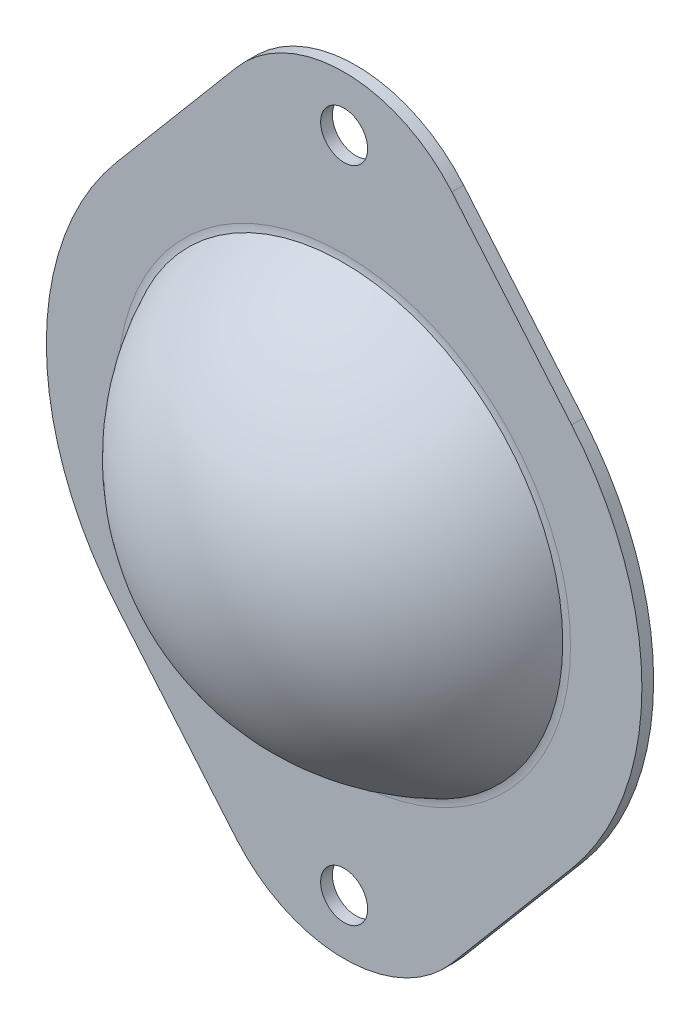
ISO-10303-21;
HEADER;
FILE_DESCRIPTION(('STEP AP214'),'2;1');
FILE_NAME('part.step','',(''),(''),'','','');
FILE_SCHEMA(('AUTOMOTIVE_DESIGN { 1 0 10303 214 1 1 1 1 }'));
ENDSEC;
DATA;
#1=APPLICATION_CONTEXT('core data for automotive mechanical design processes');
#2=APPLICATION_PROTOCOL_DEFINITION('international standard','automotive_design',2000,#1);
#3=PRODUCT_CONTEXT('',#1,'mechanical');
#4=PRODUCT('Part','Part','',(#3));
#5=PRODUCT_RELATED_PRODUCT_CATEGORY('part','',(#4));
#6=PRODUCT_DEFINITION_FORMATION('','',#4);
#7=PRODUCT_DEFINITION_CONTEXT('part definition',#1,'design');
#8=PRODUCT_DEFINITION('design','',#6,#7);
#9=PRODUCT_DEFINITION_SHAPE('','',#8);
#10=(LENGTH_UNIT() NAMED_UNIT(*) SI_UNIT(.MILLI.,.METRE.));
#11=(NAMED_UNIT(*) PLANE_ANGLE_UNIT() SI_UNIT($,.RADIAN.));
#12=(NAMED_UNIT(*) SI_UNIT($,.STERADIAN.) SOLID_ANGLE_UNIT());
#13=UNCERTAINTY_MEASURE_WITH_UNIT(LENGTH_MEASURE(1.E-05),#10,'distance_accuracy_value','');
#14=(GEOMETRIC_REPRESENTATION_CONTEXT(3) GLOBAL_UNCERTAINTY_ASSIGNED_CONTEXT((#13)) GLOBAL_UNIT_ASSIGNED_CONTEXT((#10,
#11,#12)) REPRESENTATION_CONTEXT('',''));
#15=CARTESIAN_POINT('',(0.,0.,0.));
#16=DIRECTION('',(0.,0.,1.));
#17=DIRECTION('',(1.,0.,0.));
#18=AXIS2_PLACEMENT_3D('',#15,#16,#17);
#19=CARTESIAN_POINT('',(0.,0.,1.5));
#20=DIRECTION('',(0.,0.,1.));
#21=DIRECTION('',(1.,0.,0.));
#22=AXIS2_PLACEMENT_3D('',#19,#20,#21);
#23=PLANE('',#22);
#24=CARTESIAN_POINT('',(0.,0.,1.5));
#25=DIRECTION('',(0.,0.,1.));
#26=DIRECTION('',(1.,0.,0.));
#27=AXIS2_PLACEMENT_3D('',#24,#25,#26);
#28=CIRCLE('',#27,28.8888194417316);
#29=CARTESIAN_POINT('',(28.8888194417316,0.,1.5));
#30=VERTEX_POINT('',#29);
#31=EDGE_CURVE('E40',#30,#30,#28,.F.);
#32=ORIENTED_EDGE('',*,*,#31,.T.);
#33=EDGE_LOOP('',(#32));
#34=FACE_BOUND('',#33,.T.);
#35=CARTESIAN_POINT('',(0.,-42.,1.5));
#36=DIRECTION('',(0.,0.,1.));
#37=DIRECTION('',(1.,0.,0.));
#38=AXIS2_PLACEMENT_3D('',#35,#36,#37);
#39=CIRCLE('',#38,3.);
#40=CARTESIAN_POINT('',(3.,-42.,1.5));
#41=VERTEX_POINT('',#40);
#42=EDGE_CURVE('E187',#41,#41,#39,.T.);
#43=ORIENTED_EDGE('',*,*,#42,.F.);
#44=EDGE_LOOP('',(#43));
#45=FACE_BOUND('',#44,.T.);
#46=CARTESIAN_POINT('',(0.,0.,1.5));
#47=DIRECTION('',(0.,0.,1.));
#48=DIRECTION('',(1.,0.,0.));
#49=AXIS2_PLACEMENT_3D('',#46,#47,#48);
#50=CIRCLE('',#49,38.);
#51=CARTESIAN_POINT('',(-29.033763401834,24.516129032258,1.5));
#52=VERTEX_POINT('',#51);
#53=CARTESIAN_POINT('',(-29.033763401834,-24.5161290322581,1.5));
#54=VERTEX_POINT('',#53);
#55=EDGE_CURVE('E139',#52,#54,#50,.T.);
#56=ORIENTED_EDGE('',*,*,#55,.T.);
#57=DIRECTION('',(0.645161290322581,-0.76404640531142,0.));
#58=VECTOR('',#57,1.);
#59=CARTESIAN_POINT('',(-29.033763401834,-24.5161290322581,1.5));
#60=LINE('',#59,#58);
#61=CARTESIAN_POINT('',(-13.7528352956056,-42.6129032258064,1.5));
#62=VERTEX_POINT('',#61);
#63=EDGE_CURVE('E113',#54,#62,#60,.T.);
#64=ORIENTED_EDGE('',*,*,#63,.T.);
#65=CARTESIAN_POINT('',(0.,-31.,1.5));
#66=DIRECTION('',(0.,0.,1.));
#67=DIRECTION('',(1.,0.,0.));
#68=AXIS2_PLACEMENT_3D('',#65,#66,#67);
#69=CIRCLE('',#68,18.);
#70=CARTESIAN_POINT('',(13.7528352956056,-42.6129032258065,1.5));
#71=VERTEX_POINT('',#70);
#72=EDGE_CURVE('E142',#62,#71,#69,.T.);
#73=ORIENTED_EDGE('',*,*,#72,.T.);
#74=DIRECTION('',(0.64516129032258,0.76404640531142,0.));
#75=VECTOR('',#74,1.);
#76=CARTESIAN_POINT('',(29.033763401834,-24.5161290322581,1.5));
#77=LINE('',#76,#75);
#78=CARTESIAN_POINT('',(29.033763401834,-24.5161290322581,1.5));
#79=VERTEX_POINT('',#78);
#80=EDGE_CURVE('E144',#71,#79,#77,.T.);
#81=ORIENTED_EDGE('',*,*,#80,.T.);
#82=CARTESIAN_POINT('',(0.,0.,1.5));
#83=DIRECTION('',(0.,0.,1.));
#84=DIRECTION('',(1.,0.,0.));
#85=AXIS2_PLACEMENT_3D('',#82,#83,#84);
#86=CIRCLE('',#85,38.);
#87=CARTESIAN_POINT('',(29.0337634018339,24.5161290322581,1.5));
#88=VERTEX_POINT('',#87);
#89=EDGE_CURVE('E146',#79,#88,#86,.T.);
#90=ORIENTED_EDGE('',*,*,#89,.T.);
#91=DIRECTION('',(-0.64516129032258,0.76404640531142,0.));
#92=VECTOR('',#91,1.);
#93=CARTESIAN_POINT('',(13.7528352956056,42.6129032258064,1.5));
#94=LINE('',#93,#92);
#95=CARTESIAN_POINT('',(13.7528352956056,42.6129032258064,1.5));
#96=VERTEX_POINT('',#95);
#97=EDGE_CURVE('E148',#88,#96,#94,.T.);
#98=ORIENTED_EDGE('',*,*,#97,.T.);
#99=CARTESIAN_POINT('',(0.,31.,1.5));
#100=DIRECTION('',(0.,0.,1.));
#101=DIRECTION('',(1.,0.,0.));
#102=AXIS2_PLACEMENT_3D('',#99,#100,#101);
#103=CIRCLE('',#102,18.);
#104=CARTESIAN_POINT('',(-13.7528352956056,42.6129032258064,1.5));
#105=VERTEX_POINT('',#104);
#106=EDGE_CURVE('E52',#96,#105,#103,.T.);
#107=ORIENTED_EDGE('',*,*,#106,.T.);
#108=DIRECTION('',(-0.64516129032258,-0.76404640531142,0.));
#109=VECTOR('',#108,1.);
#110=CARTESIAN_POINT('',(-13.7528352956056,42.6129032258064,1.5));
#111=LINE('',#110,#109);
#112=EDGE_CURVE('E47',#105,#52,#111,.T.);
#113=ORIENTED_EDGE('',*,*,#112,.T.);
#114=EDGE_LOOP('',(#56,#64,#73,#81,#90,#98,#107,#113));
#115=FACE_BOUND('',#114,.T.);
#116=CARTESIAN_POINT('',(0.,42.,1.5));
#117=DIRECTION('',(0.,0.,1.));
#118=DIRECTION('',(1.,0.,0.));
#119=AXIS2_PLACEMENT_3D('',#116,#117,#118);
#120=CIRCLE('',#119,3.);
#121=CARTESIAN_POINT('',(3.,42.,1.5));
#122=VERTEX_POINT('',#121);
#123=EDGE_CURVE('E121',#122,#122,#120,.T.);
#124=ORIENTED_EDGE('',*,*,#123,.F.);
#125=EDGE_LOOP('',(#124));
#126=FACE_BOUND('',#125,.T.);
#127=ADVANCED_FACE('F32',(#34,#45,#115,#126),#23,.T.);
#128=CARTESIAN_POINT('',(0.,0.,0.));
#129=DIRECTION('',(0.,0.,1.));
#130=DIRECTION('',(1.,0.,0.));
#131=AXIS2_PLACEMENT_3D('',#128,#129,#130);
#132=PLANE('',#131);
#133=CARTESIAN_POINT('',(0.,0.,0.));
#134=DIRECTION('',(0.,0.,1.));
#135=DIRECTION('',(1.,0.,0.));
#136=AXIS2_PLACEMENT_3D('',#133,#134,#135);
#137=CIRCLE('',#136,29.4232084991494);
#138=CARTESIAN_POINT('',(29.4232084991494,0.,0.));
#139=VERTEX_POINT('',#138);
#140=EDGE_CURVE('E11',#139,#139,#137,.T.);
#141=ORIENTED_EDGE('',*,*,#140,.T.);
#142=EDGE_LOOP('',(#141));
#143=FACE_BOUND('',#142,.T.);
#144=CARTESIAN_POINT('',(0.,42.,0.));
#145=DIRECTION('',(0.,0.,1.));
#146=DIRECTION('',(1.,0.,0.));
#147=AXIS2_PLACEMENT_3D('',#144,#145,#146);
#148=CIRCLE('',#147,3.);
#149=CARTESIAN_POINT('',(3.,42.,0.));
#150=VERTEX_POINT('',#149);
#151=EDGE_CURVE('E124',#150,#150,#148,.T.);
#152=ORIENTED_EDGE('',*,*,#151,.T.);
#153=EDGE_LOOP('',(#152));
#154=FACE_BOUND('',#153,.T.);
#155=CARTESIAN_POINT('',(0.,0.,0.));
#156=DIRECTION('',(0.,0.,1.));
#157=DIRECTION('',(1.,0.,0.));
#158=AXIS2_PLACEMENT_3D('',#155,#156,#157);
#159=CIRCLE('',#158,38.);
#160=CARTESIAN_POINT('',(-29.033763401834,24.516129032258,0.));
#161=VERTEX_POINT('',#160);
#162=CARTESIAN_POINT('',(-29.033763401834,-24.5161290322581,0.));
#163=VERTEX_POINT('',#162);
#164=EDGE_CURVE('E103',#161,#163,#159,.T.);
#165=ORIENTED_EDGE('',*,*,#164,.F.);
#166=DIRECTION('',(-0.64516129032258,-0.76404640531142,0.));
#167=VECTOR('',#166,1.);
#168=CARTESIAN_POINT('',(-13.7528352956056,42.6129032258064,0.));
#169=LINE('',#168,#167);
#170=CARTESIAN_POINT('',(-13.7528352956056,42.6129032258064,0.));
#171=VERTEX_POINT('',#170);
#172=EDGE_CURVE('E137',#171,#161,#169,.T.);
#173=ORIENTED_EDGE('',*,*,#172,.F.);
#174=CARTESIAN_POINT('',(0.,31.,0.));
#175=DIRECTION('',(0.,0.,1.));
#176=DIRECTION('',(1.,0.,0.));
#177=AXIS2_PLACEMENT_3D('',#174,#175,#176);
#178=CIRCLE('',#177,18.);
#179=CARTESIAN_POINT('',(13.7528352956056,42.6129032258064,0.));
#180=VERTEX_POINT('',#179);
#181=EDGE_CURVE('E135',#180,#171,#178,.T.);
#182=ORIENTED_EDGE('',*,*,#181,.F.);
#183=DIRECTION('',(-0.64516129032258,0.76404640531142,0.));
#184=VECTOR('',#183,1.);
#185=CARTESIAN_POINT('',(13.7528352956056,42.6129032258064,0.));
#186=LINE('',#185,#184);
#187=CARTESIAN_POINT('',(29.0337634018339,24.5161290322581,0.));
#188=VERTEX_POINT('',#187);
#189=EDGE_CURVE('E133',#188,#180,#186,.T.);
#190=ORIENTED_EDGE('',*,*,#189,.F.);
#191=CARTESIAN_POINT('',(0.,0.,0.));
#192=DIRECTION('',(0.,0.,1.));
#193=DIRECTION('',(1.,0.,0.));
#194=AXIS2_PLACEMENT_3D('',#191,#192,#193);
#195=CIRCLE('',#194,38.);
#196=CARTESIAN_POINT('',(29.033763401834,-24.5161290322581,0.));
#197=VERTEX_POINT('',#196);
#198=EDGE_CURVE('E131',#197,#188,#195,.T.);
#199=ORIENTED_EDGE('',*,*,#198,.F.);
#200=DIRECTION('',(0.64516129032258,0.76404640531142,0.));
#201=VECTOR('',#200,1.);
#202=CARTESIAN_POINT('',(29.033763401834,-24.5161290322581,0.));
#203=LINE('',#202,#201);
#204=CARTESIAN_POINT('',(13.7528352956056,-42.6129032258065,0.));
#205=VERTEX_POINT('',#204);
#206=EDGE_CURVE('E129',#205,#197,#203,.T.);
#207=ORIENTED_EDGE('',*,*,#206,.F.);
#208=CARTESIAN_POINT('',(0.,-31.,0.));
#209=DIRECTION('',(0.,0.,1.));
#210=DIRECTION('',(1.,0.,0.));
#211=AXIS2_PLACEMENT_3D('',#208,#209,#210);
#212=CIRCLE('',#211,18.);
#213=CARTESIAN_POINT('',(-13.7528352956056,-42.6129032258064,0.));
#214=VERTEX_POINT('',#213);
#215=EDGE_CURVE('E105',#214,#205,#212,.T.);
#216=ORIENTED_EDGE('',*,*,#215,.F.);
#217=DIRECTION('',(0.645161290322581,-0.76404640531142,0.));
#218=VECTOR('',#217,1.);
#219=CARTESIAN_POINT('',(-29.033763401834,-24.5161290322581,0.));
#220=LINE('',#219,#218);
#221=EDGE_CURVE('E97',#163,#214,#220,.T.);
#222=ORIENTED_EDGE('',*,*,#221,.F.);
#223=EDGE_LOOP('',(#165,#173,#182,#190,#199,#207,#216,#222));
#224=FACE_BOUND('',#223,.T.);
#225=CARTESIAN_POINT('',(0.,-42.,0.));
#226=DIRECTION('',(0.,0.,1.));
#227=DIRECTION('',(1.,0.,0.));
#228=AXIS2_PLACEMENT_3D('',#225,#226,#227);
#229=CIRCLE('',#228,3.);
#230=CARTESIAN_POINT('',(3.,-42.,0.));
#231=VERTEX_POINT('',#230);
#232=EDGE_CURVE('E183',#231,#231,#229,.T.);
#233=ORIENTED_EDGE('',*,*,#232,.T.);
#234=EDGE_LOOP('',(#233));
#235=FACE_BOUND('',#234,.T.);
#236=ADVANCED_FACE('F99',(#143,#154,#224,#235),#132,.F.);
#237=CARTESIAN_POINT('',(0.,0.,1.5));
#238=DIRECTION('',(0.,0.,-1.));
#239=DIRECTION('',(-1.,0.,0.));
#240=AXIS2_PLACEMENT_3D('',#237,#238,#239);
#241=CYLINDRICAL_SURFACE('',#240,38.);
#242=ORIENTED_EDGE('',*,*,#164,.T.);
#243=DIRECTION('',(0.,0.,-1.));
#244=VECTOR('',#243,1.);
#245=CARTESIAN_POINT('',(-29.033763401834,-24.5161290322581,1.5));
#246=LINE('',#245,#244);
#247=EDGE_CURVE('E111',#54,#163,#246,.T.);
#248=ORIENTED_EDGE('',*,*,#247,.F.);
#249=ORIENTED_EDGE('',*,*,#55,.F.);
#250=DIRECTION('',(0.,0.,-1.));
#251=VECTOR('',#250,1.);
#252=CARTESIAN_POINT('',(-29.033763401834,24.516129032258,1.5));
#253=LINE('',#252,#251);
#254=EDGE_CURVE('E120',#52,#161,#253,.T.);
#255=ORIENTED_EDGE('',*,*,#254,.T.);
#256=EDGE_LOOP('',(#242,#248,#249,#255));
#257=FACE_BOUND('',#256,.T.);
#258=ADVANCED_FACE('F119',(#257),#241,.T.);
#259=CARTESIAN_POINT('',(-29.033763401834,-24.5161290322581,1.5));
#260=DIRECTION('',(0.76404640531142,0.64516129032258,0.));
#261=DIRECTION('',(-0.645161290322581,0.76404640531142,0.));
#262=AXIS2_PLACEMENT_3D('',#259,#260,#261);
#263=PLANE('',#262);
#264=ORIENTED_EDGE('',*,*,#221,.T.);
#265=DIRECTION('',(0.,0.,-1.));
#266=VECTOR('',#265,1.);
#267=CARTESIAN_POINT('',(-13.7528352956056,-42.6129032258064,1.5));
#268=LINE('',#267,#266);
#269=EDGE_CURVE('E116',#62,#214,#268,.T.);
#270=ORIENTED_EDGE('',*,*,#269,.F.);
#271=ORIENTED_EDGE('',*,*,#63,.F.);
#272=ORIENTED_EDGE('',*,*,#247,.T.);
#273=EDGE_LOOP('',(#264,#270,#271,#272));
#274=FACE_BOUND('',#273,.T.);
#275=ADVANCED_FACE('F112',(#274),#263,.F.);
#276=CARTESIAN_POINT('',(0.,-31.,1.5));
#277=DIRECTION('',(0.,0.,-1.));
#278=DIRECTION('',(-1.,0.,0.));
#279=AXIS2_PLACEMENT_3D('',#276,#277,#278);
#280=CYLINDRICAL_SURFACE('',#279,18.);
#281=ORIENTED_EDGE('',*,*,#215,.T.);
#282=DIRECTION('',(0.,0.,-1.));
#283=VECTOR('',#282,1.);
#284=CARTESIAN_POINT('',(13.7528352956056,-42.6129032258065,1.5));
#285=LINE('',#284,#283);
#286=EDGE_CURVE('E165',#71,#205,#285,.T.);
#287=ORIENTED_EDGE('',*,*,#286,.F.);
#288=ORIENTED_EDGE('',*,*,#72,.F.);
#289=ORIENTED_EDGE('',*,*,#269,.T.);
#290=EDGE_LOOP('',(#281,#287,#288,#289));
#291=FACE_BOUND('',#290,.T.);
#292=ADVANCED_FACE('F234',(#291),#280,.T.);
#293=CARTESIAN_POINT('',(29.033763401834,-24.5161290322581,1.5));
#294=DIRECTION('',(-0.76404640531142,0.64516129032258,0.));
#295=DIRECTION('',(-0.645161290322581,-0.76404640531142,0.));
#296=AXIS2_PLACEMENT_3D('',#293,#294,#295);
#297=PLANE('',#296);
#298=ORIENTED_EDGE('',*,*,#206,.T.);
#299=DIRECTION('',(0.,0.,-1.));
#300=VECTOR('',#299,1.);
#301=CARTESIAN_POINT('',(29.033763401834,-24.5161290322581,1.5));
#302=LINE('',#301,#300);
#303=EDGE_CURVE('E162',#79,#197,#302,.T.);
#304=ORIENTED_EDGE('',*,*,#303,.F.);
#305=ORIENTED_EDGE('',*,*,#80,.F.);
#306=ORIENTED_EDGE('',*,*,#286,.T.);
#307=EDGE_LOOP('',(#298,#304,#305,#306));
#308=FACE_BOUND('',#307,.T.);
#309=ADVANCED_FACE('F230',(#308),#297,.F.);
#310=CARTESIAN_POINT('',(0.,0.,1.5));
#311=DIRECTION('',(0.,0.,-1.));
#312=DIRECTION('',(-1.,0.,0.));
#313=AXIS2_PLACEMENT_3D('',#310,#311,#312);
#314=CYLINDRICAL_SURFACE('',#313,38.);
#315=ORIENTED_EDGE('',*,*,#198,.T.);
#316=DIRECTION('',(0.,0.,-1.));
#317=VECTOR('',#316,1.);
#318=CARTESIAN_POINT('',(29.0337634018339,24.5161290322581,1.5));
#319=LINE('',#318,#317);
#320=EDGE_CURVE('E159',#88,#188,#319,.T.);
#321=ORIENTED_EDGE('',*,*,#320,.F.);
#322=ORIENTED_EDGE('',*,*,#89,.F.);
#323=ORIENTED_EDGE('',*,*,#303,.T.);
#324=EDGE_LOOP('',(#315,#321,#322,#323));
#325=FACE_BOUND('',#324,.T.);
#326=ADVANCED_FACE('F226',(#325),#314,.T.);
#327=CARTESIAN_POINT('',(13.7528352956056,42.6129032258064,1.5));
#328=DIRECTION('',(-0.76404640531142,-0.64516129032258,0.));
#329=DIRECTION('',(0.64516129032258,-0.76404640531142,0.));
#330=AXIS2_PLACEMENT_3D('',#327,#328,#329);
#331=PLANE('',#330);
#332=ORIENTED_EDGE('',*,*,#189,.T.);
#333=DIRECTION('',(0.,0.,-1.));
#334=VECTOR('',#333,1.);
#335=CARTESIAN_POINT('',(13.7528352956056,42.6129032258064,1.5));
#336=LINE('',#335,#334);
#337=EDGE_CURVE('E156',#96,#180,#336,.T.);
#338=ORIENTED_EDGE('',*,*,#337,.F.);
#339=ORIENTED_EDGE('',*,*,#97,.F.);
#340=ORIENTED_EDGE('',*,*,#320,.T.);
#341=EDGE_LOOP('',(#332,#338,#339,#340));
#342=FACE_BOUND('',#341,.T.);
#343=ADVANCED_FACE('F222',(#342),#331,.F.);
#344=CARTESIAN_POINT('',(0.,31.,1.5));
#345=DIRECTION('',(0.,0.,-1.));
#346=DIRECTION('',(-1.,0.,0.));
#347=AXIS2_PLACEMENT_3D('',#344,#345,#346);
#348=CYLINDRICAL_SURFACE('',#347,18.);
#349=ORIENTED_EDGE('',*,*,#181,.T.);
#350=DIRECTION('',(0.,0.,-1.));
#351=VECTOR('',#350,1.);
#352=CARTESIAN_POINT('',(-13.7528352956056,42.6129032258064,1.5));
#353=LINE('',#352,#351);
#354=EDGE_CURVE('E153',#105,#171,#353,.T.);
#355=ORIENTED_EDGE('',*,*,#354,.F.);
#356=ORIENTED_EDGE('',*,*,#106,.F.);
#357=ORIENTED_EDGE('',*,*,#337,.T.);
#358=EDGE_LOOP('',(#349,#355,#356,#357));
#359=FACE_BOUND('',#358,.T.);
#360=ADVANCED_FACE('F209',(#359),#348,.T.);
#361=CARTESIAN_POINT('',(-13.7528352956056,42.6129032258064,1.5));
#362=DIRECTION('',(0.76404640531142,-0.64516129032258,0.));
#363=DIRECTION('',(0.645161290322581,0.76404640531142,0.));
#364=AXIS2_PLACEMENT_3D('',#361,#362,#363);
#365=PLANE('',#364);
#366=ORIENTED_EDGE('',*,*,#172,.T.);
#367=ORIENTED_EDGE('',*,*,#254,.F.);
#368=ORIENTED_EDGE('',*,*,#112,.F.);
#369=ORIENTED_EDGE('',*,*,#354,.T.);
#370=EDGE_LOOP('',(#366,#367,#368,#369));
#371=FACE_BOUND('',#370,.T.);
#372=ADVANCED_FACE('F200',(#371),#365,.F.);
#373=CARTESIAN_POINT('',(0.,42.,1.5));
#374=DIRECTION('',(0.,0.,-1.));
#375=DIRECTION('',(-1.,0.,0.));
#376=AXIS2_PLACEMENT_3D('',#373,#374,#375);
#377=CYLINDRICAL_SURFACE('',#376,3.);
#378=ORIENTED_EDGE('',*,*,#123,.T.);
#379=EDGE_LOOP('',(#378));
#380=FACE_BOUND('',#379,.T.);
#381=ORIENTED_EDGE('',*,*,#151,.F.);
#382=EDGE_LOOP('',(#381));
#383=FACE_BOUND('',#382,.T.);
#384=ADVANCED_FACE('F197',(#380,#383),#377,.F.);
#385=CARTESIAN_POINT('',(0.,-42.,1.5));
#386=DIRECTION('',(0.,0.,-1.));
#387=DIRECTION('',(-1.,0.,0.));
#388=AXIS2_PLACEMENT_3D('',#385,#386,#387);
#389=CYLINDRICAL_SURFACE('',#388,3.);
#390=ORIENTED_EDGE('',*,*,#42,.T.);
#391=EDGE_LOOP('',(#390));
#392=FACE_BOUND('',#391,.T.);
#393=ORIENTED_EDGE('',*,*,#232,.F.);
#394=EDGE_LOOP('',(#393));
#395=FACE_BOUND('',#394,.T.);
#396=ADVANCED_FACE('F199',(#392,#395),#389,.F.);
#397=CARTESIAN_POINT('',(0.,0.,-11.1777777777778));
#398=DIRECTION('',(0.,0.,1.));
#399=DIRECTION('',(1.,0.,0.));
#400=AXIS2_PLACEMENT_3D('',#397,#398,#399);
#401=SPHERICAL_SURFACE('',#400,30.7777777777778);
#402=CARTESIAN_POINT('',(0.,0.,1.6));
#403=DIRECTION('',(0.,0.,1.));
#404=DIRECTION('',(1.,0.,0.));
#405=AXIS2_PLACEMENT_3D('',#402,#403,#404);
#406=CIRCLE('',#405,28.);
#407=CARTESIAN_POINT('',(28.,0.,1.6));
#408=VERTEX_POINT('',#407);
#409=EDGE_CURVE('E181',#408,#408,#406,.T.);
#410=ORIENTED_EDGE('',*,*,#409,.T.);
#411=EDGE_LOOP('',(#410));
#412=FACE_BOUND('',#411,.T.);
#413=ADVANCED_FACE('F34',(#412),#401,.T.);
#414=CARTESIAN_POINT('',(0.,0.,-11.1777777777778));
#415=DIRECTION('',(0.,0.,1.));
#416=DIRECTION('',(1.,0.,0.));
#417=AXIS2_PLACEMENT_3D('',#414,#415,#416);
#418=SPHERICAL_SURFACE('',#417,29.2777777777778);
#419=CARTESIAN_POINT('',(0.,0.,1.26964250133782));
#420=DIRECTION('',(0.,0.,-1.));
#421=DIRECTION('',(-1.,0.,0.));
#422=AXIS2_PLACEMENT_3D('',#419,#420,#421);
#423=CIRCLE('',#422,26.5);
#424=CARTESIAN_POINT('',(-26.5,0.,1.26964250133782));
#425=VERTEX_POINT('',#424);
#426=EDGE_CURVE('E184',#425,#425,#423,.F.);
#427=ORIENTED_EDGE('',*,*,#426,.F.);
#428=EDGE_LOOP('',(#427));
#429=FACE_BOUND('',#428,.T.);
#430=ADVANCED_FACE('F177',(#429),#418,.F.);
#431=CARTESIAN_POINT('',(0.,0.,5.5));
#432=DIRECTION('',(0.,0.,1.));
#433=DIRECTION('',(1.,0.,0.));
#434=AXIS2_PLACEMENT_3D('',#431,#432,#433);
#435=TOROIDAL_SURFACE('',#434,28.8888194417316,4.);
#436=ORIENTED_EDGE('',*,*,#31,.F.);
#437=EDGE_LOOP('',(#436));
#438=FACE_BOUND('',#437,.T.);
#439=ORIENTED_EDGE('',*,*,#409,.F.);
#440=EDGE_LOOP('',(#439));
#441=FACE_BOUND('',#440,.T.);
#442=ADVANCED_FACE('F173',(#438,#441),#435,.F.);
#443=CARTESIAN_POINT('',(0.,0.,4.));
#444=DIRECTION('',(0.,0.,1.));
#445=DIRECTION('',(1.,0.,0.));
#446=AXIS2_PLACEMENT_3D('',#443,#444,#445);
#447=TOROIDAL_SURFACE('',#446,29.4232084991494,4.);
#448=ORIENTED_EDGE('',*,*,#426,.T.);
#449=EDGE_LOOP('',(#448));
#450=FACE_BOUND('',#449,.T.);
#451=ORIENTED_EDGE('',*,*,#140,.F.);
#452=EDGE_LOOP('',(#451));
#453=FACE_BOUND('',#452,.T.);
#454=ADVANCED_FACE('F176',(#450,#453),#447,.T.);
#455=CLOSED_SHELL('',(#127,#236,#258,#275,#292,#309,#326,#343,#360,#372,#384,#396,#413,#430,
#442,#454));
#456=MANIFOLD_SOLID_BREP('B2',#455);
#457=ADVANCED_BREP_SHAPE_REPRESENTATION('',(#18,#456),#14);
#458=SHAPE_DEFINITION_REPRESENTATION(#9,#457);
ENDSEC;
END-ISO-10303-21;
